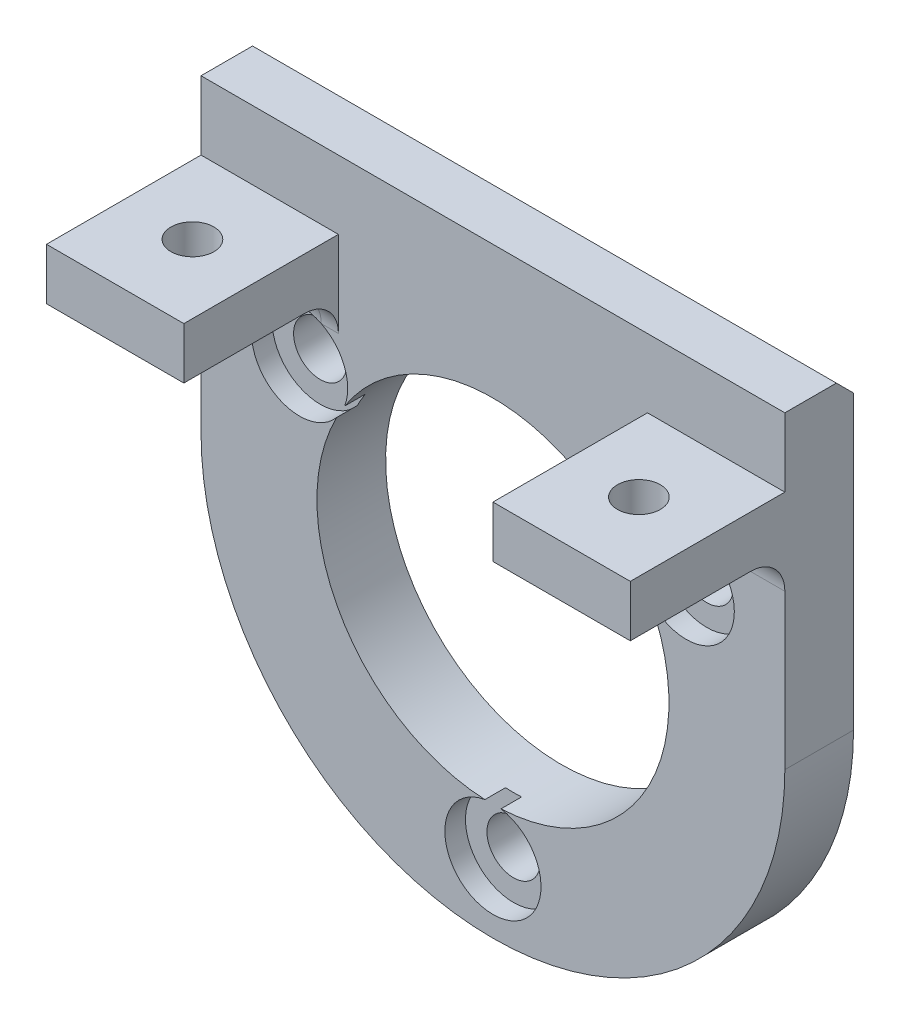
from build123d import *

# Parameters (mm, degrees)
SKETCH_1_R               = 17
SKETCH_1_R_2             = 10.25
EXTRUDE_1_DEPTH          = 2
CUT_EXTRUDE_1_DEPTH      = 25.124676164
CUT_EXTRUDE_1_DEPTH_BACK = 25.124676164
SKETCH_2_R               = 1.55
SKETCH_3_R               = 2.8
CUT_EXTRUDE_5_DEPTH      = 1.2
EXTRUDE_2_DEPTH          = 2
SKETCH_5_W               = 8
SKETCH_5_H               = 3
EXTRUDE_3_DEPTH          = 9
SKETCH_6_W               = 34
SKETCH_6_H               = 4
EXTRUDE_4_DEPTH          = 4
HOLE_WIZARD_M3_2_D       = 2.5
FILLET_1_R               = 2
CHAMFER_1_SIZE           = 1


with BuildPart() as part:
    # Sketch 1 → Extrude 1 (new, symmetric)
    with BuildSketch(Plane.XY):
        Circle(SKETCH_1_R)
        Circle(SKETCH_1_R_2, mode=Mode.SUBTRACT)
    extrude(amount=EXTRUDE_1_DEPTH, both=True)

    # Sketch 2 → Cut-Extrude 1 (cut, two sides: drawn at the far end of the back side and taken through both)
    with BuildSketch(Plane.XY.offset(-CUT_EXTRUDE_1_DEPTH_BACK)):
        with Locations((11.258330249, 6.5)):
            Circle(SKETCH_2_R)
        with Locations((-11.258330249, 6.5)):
            Circle(SKETCH_2_R)
        with Locations((0, -13)):
            Circle(SKETCH_2_R)
    extrude(amount=CUT_EXTRUDE_1_DEPTH + CUT_EXTRUDE_1_DEPTH_BACK, mode=Mode.SUBTRACT)

    # Sketch 3 → Cut-Extrude 5 (cut)
    with BuildSketch(Plane.XY.offset(2)):
        with Locations((-11.258330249, 6.5)):
            Circle(SKETCH_3_R)
        with Locations((11.258330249, 6.5)):
            Circle(SKETCH_3_R)
        with Locations((0, -13)):
            Circle(SKETCH_3_R)
    extrude(amount=-CUT_EXTRUDE_5_DEPTH, mode=Mode.SUBTRACT)

    # Sketch 4 → Extrude 2 (add, symmetric)
    with BuildSketch(Plane.XY):
        with BuildLine():
            Line((-17, 14), (-17, 0))
            ThreePointArc((-17, 0), (-15.048954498, 7.907526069), (-9.643650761, 14))
            Line((-9.643650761, 14), (-17, 14))
        make_face()
        with BuildLine():
            Line((17, 14), (9.643650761, 14))
            ThreePointArc((9.643650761, 14), (15.048954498, 7.907526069), (17, 0))
            Line((17, 0), (17, 14))
        make_face()
    extrude(amount=EXTRUDE_2_DEPTH, both=True)

    # Sketch 5 → Extrude 3 (add)
    with BuildSketch(Plane.XY.offset(2)):
        with Locations((-13, 12.5)):
            Rectangle(SKETCH_5_W, SKETCH_5_H)
        with Locations((13, 12.5)):
            Rectangle(SKETCH_5_W, SKETCH_5_H)
    extrude(amount=EXTRUDE_3_DEPTH)

    # Sketch 6 → Extrude 4 (add)
    with BuildSketch(Plane.XY.offset(2)):
        with Locations((0, 16)):
            Rectangle(SKETCH_6_W, SKETCH_6_H)
    extrude(amount=-EXTRUDE_4_DEPTH)

    # Hole Wizard M3 _2 (through all)
    with Locations(Plane(origin=(0, 14, 0), x_dir=(1, 0, 0), z_dir=(0, 1, 0))):
        with Locations((-13, -6.5), (13, -6.5)):
            Hole(HOLE_WIZARD_M3_2_D / 2)

    # Fillet 1
    fillet_1_edges = [part.edges().sort_by_distance(p)[0] for p in [
        (-13, 11, 2),
        (13, 11, 2),
    ]]
    fillet(fillet_1_edges, radius=FILLET_1_R)

    # Chamfer 1
    chamfer_1_edges = [part.edges().sort_by_distance(p)[0] for p in [
        (0, 18, -2),
    ]]
    chamfer(chamfer_1_edges, length=CHAMFER_1_SIZE)


solid = part.part
